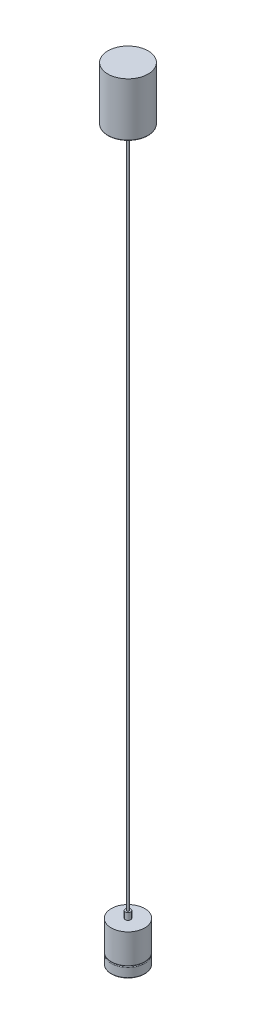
ISO-10303-21;
HEADER;
FILE_DESCRIPTION(('STEP AP214'),'2;1');
FILE_NAME('part.step','',(''),(''),'','','');
FILE_SCHEMA(('AUTOMOTIVE_DESIGN { 1 0 10303 214 1 1 1 1 }'));
ENDSEC;
DATA;
#1=APPLICATION_CONTEXT('core data for automotive mechanical design processes');
#2=APPLICATION_PROTOCOL_DEFINITION('international standard','automotive_design',2000,#1);
#3=PRODUCT_CONTEXT('',#1,'mechanical');
#4=PRODUCT('Part','Part','',(#3));
#5=PRODUCT_RELATED_PRODUCT_CATEGORY('part','',(#4));
#6=PRODUCT_DEFINITION_FORMATION('','',#4);
#7=PRODUCT_DEFINITION_CONTEXT('part definition',#1,'design');
#8=PRODUCT_DEFINITION('design','',#6,#7);
#9=PRODUCT_DEFINITION_SHAPE('','',#8);
#10=(LENGTH_UNIT() NAMED_UNIT(*) SI_UNIT(.MILLI.,.METRE.));
#11=(NAMED_UNIT(*) PLANE_ANGLE_UNIT() SI_UNIT($,.RADIAN.));
#12=(NAMED_UNIT(*) SI_UNIT($,.STERADIAN.) SOLID_ANGLE_UNIT());
#13=UNCERTAINTY_MEASURE_WITH_UNIT(LENGTH_MEASURE(1.E-05),#10,'distance_accuracy_value','');
#14=(GEOMETRIC_REPRESENTATION_CONTEXT(3) GLOBAL_UNCERTAINTY_ASSIGNED_CONTEXT((#13)) GLOBAL_UNIT_ASSIGNED_CONTEXT((#10,
#11,#12)) REPRESENTATION_CONTEXT('',''));
#15=CARTESIAN_POINT('',(0.,0.,0.));
#16=DIRECTION('',(0.,0.,1.));
#17=DIRECTION('',(1.,0.,0.));
#18=AXIS2_PLACEMENT_3D('',#15,#16,#17);
#19=CARTESIAN_POINT('',(-120.404013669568,-535.594040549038,1100.));
#20=DIRECTION('',(0.,1.,0.));
#21=DIRECTION('',(0.0841846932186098,0.,0.996450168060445));
#22=AXIS2_PLACEMENT_3D('',#19,#20,#21);
#23=CYLINDRICAL_SURFACE('',#22,15.);
#24=CARTESIAN_POINT('',(-120.404013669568,-535.594040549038,1100.));
#25=DIRECTION('',(0.,-1.,0.));
#26=DIRECTION('',(-0.0841846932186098,0.,-0.996450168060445));
#27=AXIS2_PLACEMENT_3D('',#24,#25,#26);
#28=CIRCLE('',#27,15.);
#29=CARTESIAN_POINT('',(-121.666784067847,-535.594040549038,1085.05324747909));
#30=VERTEX_POINT('',#29);
#31=EDGE_CURVE('P0_E10',#30,#30,#28,.T.);
#32=ORIENTED_EDGE('',*,*,#31,.F.);
#33=EDGE_LOOP('',(#32));
#34=FACE_BOUND('',#33,.T.);
#35=CARTESIAN_POINT('',(-120.404013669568,-535.394040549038,1100.));
#36=DIRECTION('',(0.,-1.,0.));
#37=DIRECTION('',(-0.0841846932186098,0.,-0.996450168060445));
#38=AXIS2_PLACEMENT_3D('',#35,#36,#37);
#39=CIRCLE('',#38,15.);
#40=CARTESIAN_POINT('',(-121.666784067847,-535.394040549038,1085.05324747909));
#41=VERTEX_POINT('',#40);
#42=EDGE_CURVE('P0_E18',#41,#41,#39,.T.);
#43=ORIENTED_EDGE('',*,*,#42,.T.);
#44=EDGE_LOOP('',(#43));
#45=FACE_BOUND('',#44,.T.);
#46=ADVANCED_FACE('P0_F15',(#34,#45),#23,.T.);
#47=CARTESIAN_POINT('',(-120.404013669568,-535.594040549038,1100.));
#48=DIRECTION('',(0.,-1.,0.));
#49=DIRECTION('',(-0.0841846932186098,0.,-0.996450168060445));
#50=AXIS2_PLACEMENT_3D('',#47,#48,#49);
#51=PLANE('',#50);
#52=ORIENTED_EDGE('',*,*,#31,.T.);
#53=EDGE_LOOP('',(#52));
#54=FACE_BOUND('',#53,.T.);
#55=ADVANCED_FACE('P0_F30',(#54),#51,.T.);
#56=CARTESIAN_POINT('',(-120.404013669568,-535.394040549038,1100.));
#57=DIRECTION('',(0.,-1.,0.));
#58=DIRECTION('',(-0.0841846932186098,0.,-0.996450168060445));
#59=AXIS2_PLACEMENT_3D('',#56,#57,#58);
#60=PLANE('',#59);
#61=ORIENTED_EDGE('',*,*,#42,.F.);
#62=EDGE_LOOP('',(#61));
#63=FACE_BOUND('',#62,.T.);
#64=ADVANCED_FACE('P0_F28',(#63),#60,.F.);
#65=CLOSED_SHELL('',(#46,#55,#64));
#66=MANIFOLD_SOLID_BREP('P0_B1',#65);
#67=CARTESIAN_POINT('',(-120.404013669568,-465.394040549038,1100.));
#68=DIRECTION('',(0.,1.,0.));
#69=DIRECTION('',(0.,0.,1.));
#70=AXIS2_PLACEMENT_3D('',#67,#68,#69);
#71=CYLINDRICAL_SURFACE('',#70,1.5);
#72=CARTESIAN_POINT('',(-120.404013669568,-465.394040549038,1100.));
#73=DIRECTION('',(0.,-1.,0.));
#74=DIRECTION('',(0.,0.,-1.));
#75=AXIS2_PLACEMENT_3D('',#72,#73,#74);
#76=CIRCLE('',#75,1.5);
#77=CARTESIAN_POINT('',(-120.404013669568,-465.394040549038,1098.5));
#78=VERTEX_POINT('',#77);
#79=EDGE_CURVE('P1_E10',#78,#78,#76,.T.);
#80=ORIENTED_EDGE('',*,*,#79,.F.);
#81=EDGE_LOOP('',(#80));
#82=FACE_BOUND('',#81,.T.);
#83=CARTESIAN_POINT('',(-120.404013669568,534.605959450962,1100.));
#84=DIRECTION('',(0.,-1.,0.));
#85=DIRECTION('',(0.,0.,-1.));
#86=AXIS2_PLACEMENT_3D('',#83,#84,#85);
#87=CIRCLE('',#86,1.5);
#88=CARTESIAN_POINT('',(-120.404013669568,534.605959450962,1098.5));
#89=VERTEX_POINT('',#88);
#90=EDGE_CURVE('P1_E18',#89,#89,#87,.T.);
#91=ORIENTED_EDGE('',*,*,#90,.T.);
#92=EDGE_LOOP('',(#91));
#93=FACE_BOUND('',#92,.T.);
#94=ADVANCED_FACE('P1_F15',(#82,#93),#71,.T.);
#95=CARTESIAN_POINT('',(-120.404013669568,534.605959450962,1100.));
#96=DIRECTION('',(0.,-1.,0.));
#97=DIRECTION('',(0.,0.,-1.));
#98=AXIS2_PLACEMENT_3D('',#95,#96,#97);
#99=PLANE('',#98);
#100=ORIENTED_EDGE('',*,*,#90,.F.);
#101=EDGE_LOOP('',(#100));
#102=FACE_BOUND('',#101,.T.);
#103=ADVANCED_FACE('P1_F38',(#102),#99,.F.);
#104=CARTESIAN_POINT('',(-120.404013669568,-475.394040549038,1100.));
#105=DIRECTION('',(0.,1.,0.));
#106=DIRECTION('',(0.,0.,1.));
#107=AXIS2_PLACEMENT_3D('',#104,#105,#106);
#108=CYLINDRICAL_SURFACE('',#107,4.);
#109=CARTESIAN_POINT('',(-120.404013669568,-475.394040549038,1100.));
#110=DIRECTION('',(0.,-1.,0.));
#111=DIRECTION('',(0.,0.,-1.));
#112=AXIS2_PLACEMENT_3D('',#109,#110,#111);
#113=CIRCLE('',#112,4.);
#114=CARTESIAN_POINT('',(-120.404013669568,-475.394040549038,1096.));
#115=VERTEX_POINT('',#114);
#116=EDGE_CURVE('P1_E25',#115,#115,#113,.T.);
#117=ORIENTED_EDGE('',*,*,#116,.F.);
#118=EDGE_LOOP('',(#117));
#119=FACE_BOUND('',#118,.T.);
#120=CARTESIAN_POINT('',(-120.404013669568,-465.394040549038,1100.));
#121=DIRECTION('',(0.,-1.,0.));
#122=DIRECTION('',(0.,0.,-1.));
#123=AXIS2_PLACEMENT_3D('',#120,#121,#122);
#124=CIRCLE('',#123,4.);
#125=CARTESIAN_POINT('',(-120.404013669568,-465.394040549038,1096.));
#126=VERTEX_POINT('',#125);
#127=EDGE_CURVE('P1_E27',#126,#126,#124,.T.);
#128=ORIENTED_EDGE('',*,*,#127,.T.);
#129=EDGE_LOOP('',(#128));
#130=FACE_BOUND('',#129,.T.);
#131=ADVANCED_FACE('P1_F35',(#119,#130),#108,.T.);
#132=CARTESIAN_POINT('',(-120.404013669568,-475.394040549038,1100.));
#133=DIRECTION('',(0.,-1.,0.));
#134=DIRECTION('',(0.,0.,-1.));
#135=AXIS2_PLACEMENT_3D('',#132,#133,#134);
#136=PLANE('',#135);
#137=ORIENTED_EDGE('',*,*,#116,.T.);
#138=EDGE_LOOP('',(#137));
#139=FACE_BOUND('',#138,.T.);
#140=ADVANCED_FACE('P1_F33',(#139),#136,.T.);
#141=CARTESIAN_POINT('',(-120.404013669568,-465.394040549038,1100.));
#142=DIRECTION('',(0.,-1.,0.));
#143=DIRECTION('',(0.,0.,-1.));
#144=AXIS2_PLACEMENT_3D('',#141,#142,#143);
#145=PLANE('',#144);
#146=ORIENTED_EDGE('',*,*,#79,.T.);
#147=EDGE_LOOP('',(#146));
#148=FACE_BOUND('',#147,.T.);
#149=ORIENTED_EDGE('',*,*,#127,.F.);
#150=EDGE_LOOP('',(#149));
#151=FACE_BOUND('',#150,.T.);
#152=ADVANCED_FACE('P1_F42',(#148,#151),#145,.F.);
#153=CLOSED_SHELL('',(#94,#103,#131,#140,#152));
#154=MANIFOLD_SOLID_BREP('P1_B1',#153);
#155=CARTESIAN_POINT('',(-120.404013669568,534.605959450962,1100.));
#156=DIRECTION('',(0.,1.,0.));
#157=DIRECTION('',(0.,0.,1.));
#158=AXIS2_PLACEMENT_3D('',#155,#156,#157);
#159=CYLINDRICAL_SURFACE('',#158,7.5);
#160=CARTESIAN_POINT('',(-120.404013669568,534.605959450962,1100.));
#161=DIRECTION('',(0.,-1.,0.));
#162=DIRECTION('',(0.,0.,-1.));
#163=AXIS2_PLACEMENT_3D('',#160,#161,#162);
#164=CIRCLE('',#163,7.5);
#165=CARTESIAN_POINT('',(-120.404013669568,534.605959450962,1092.5));
#166=VERTEX_POINT('',#165);
#167=EDGE_CURVE('P2_E10',#166,#166,#164,.T.);
#168=ORIENTED_EDGE('',*,*,#167,.F.);
#169=EDGE_LOOP('',(#168));
#170=FACE_BOUND('',#169,.T.);
#171=CARTESIAN_POINT('',(-120.404013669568,549.605959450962,1100.));
#172=DIRECTION('',(0.,-1.,0.));
#173=DIRECTION('',(0.,0.,-1.));
#174=AXIS2_PLACEMENT_3D('',#171,#172,#173);
#175=CIRCLE('',#174,7.5);
#176=CARTESIAN_POINT('',(-120.404013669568,549.605959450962,1092.5));
#177=VERTEX_POINT('',#176);
#178=EDGE_CURVE('P2_E18',#177,#177,#175,.T.);
#179=ORIENTED_EDGE('',*,*,#178,.T.);
#180=EDGE_LOOP('',(#179));
#181=FACE_BOUND('',#180,.T.);
#182=ADVANCED_FACE('P2_F15',(#170,#181),#159,.T.);
#183=CARTESIAN_POINT('',(-120.404013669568,534.605959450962,1100.));
#184=DIRECTION('',(0.,-1.,0.));
#185=DIRECTION('',(0.,0.,-1.));
#186=AXIS2_PLACEMENT_3D('',#183,#184,#185);
#187=PLANE('',#186);
#188=ORIENTED_EDGE('',*,*,#167,.T.);
#189=EDGE_LOOP('',(#188));
#190=FACE_BOUND('',#189,.T.);
#191=ADVANCED_FACE('P2_F30',(#190),#187,.T.);
#192=CARTESIAN_POINT('',(-120.404013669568,549.605959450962,1100.));
#193=DIRECTION('',(0.,-1.,0.));
#194=DIRECTION('',(0.,0.,-1.));
#195=AXIS2_PLACEMENT_3D('',#192,#193,#194);
#196=PLANE('',#195);
#197=ORIENTED_EDGE('',*,*,#178,.F.);
#198=EDGE_LOOP('',(#197));
#199=FACE_BOUND('',#198,.T.);
#200=ADVANCED_FACE('P2_F28',(#199),#196,.F.);
#201=CLOSED_SHELL('',(#182,#191,#200));
#202=MANIFOLD_SOLID_BREP('P2_B1',#201);
#203=CARTESIAN_POINT('',(-120.404013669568,629.605959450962,1100.));
#204=DIRECTION('',(0.,-1.,0.));
#205=DIRECTION('',(0.,0.,-1.));
#206=AXIS2_PLACEMENT_3D('',#203,#204,#205);
#207=CYLINDRICAL_SURFACE('',#206,30.);
#208=CARTESIAN_POINT('',(-120.404013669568,550.605959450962,1100.));
#209=DIRECTION('',(0.,1.,0.));
#210=DIRECTION('',(0.,0.,1.));
#211=AXIS2_PLACEMENT_3D('',#208,#209,#210);
#212=CIRCLE('',#211,30.);
#213=CARTESIAN_POINT('',(-120.404013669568,550.605959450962,1130.));
#214=VERTEX_POINT('',#213);
#215=EDGE_CURVE('P3_E22',#214,#214,#212,.T.);
#216=ORIENTED_EDGE('',*,*,#215,.T.);
#217=EDGE_LOOP('',(#216));
#218=FACE_BOUND('',#217,.T.);
#219=CARTESIAN_POINT('',(-120.404013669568,629.605959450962,1100.));
#220=DIRECTION('',(0.,1.,0.));
#221=DIRECTION('',(0.,0.,1.));
#222=AXIS2_PLACEMENT_3D('',#219,#220,#221);
#223=CIRCLE('',#222,30.);
#224=CARTESIAN_POINT('',(-120.404013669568,629.605959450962,1130.));
#225=VERTEX_POINT('',#224);
#226=EDGE_CURVE('P3_E26',#225,#225,#223,.T.);
#227=ORIENTED_EDGE('',*,*,#226,.F.);
#228=EDGE_LOOP('',(#227));
#229=FACE_BOUND('',#228,.T.);
#230=ADVANCED_FACE('P3_F15',(#218,#229),#207,.T.);
#231=CARTESIAN_POINT('',(-120.404013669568,629.605959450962,1100.));
#232=DIRECTION('',(0.,1.,0.));
#233=DIRECTION('',(0.,0.,1.));
#234=AXIS2_PLACEMENT_3D('',#231,#232,#233);
#235=PLANE('',#234);
#236=ORIENTED_EDGE('',*,*,#226,.T.);
#237=EDGE_LOOP('',(#236));
#238=FACE_BOUND('',#237,.T.);
#239=ADVANCED_FACE('P3_F33',(#238),#235,.T.);
#240=CARTESIAN_POINT('',(-120.404013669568,549.605959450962,1100.));
#241=DIRECTION('',(0.,1.,0.));
#242=DIRECTION('',(0.,0.,1.));
#243=AXIS2_PLACEMENT_3D('',#240,#241,#242);
#244=PLANE('',#243);
#245=CARTESIAN_POINT('',(-120.404013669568,549.605959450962,1100.));
#246=DIRECTION('',(0.,1.,0.));
#247=DIRECTION('',(0.,0.,1.));
#248=AXIS2_PLACEMENT_3D('',#245,#246,#247);
#249=CIRCLE('',#248,29.);
#250=CARTESIAN_POINT('',(-120.404013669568,549.605959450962,1129.));
#251=VERTEX_POINT('',#250);
#252=EDGE_CURVE('P3_E10',#251,#251,#249,.F.);
#253=ORIENTED_EDGE('',*,*,#252,.T.);
#254=EDGE_LOOP('',(#253));
#255=FACE_BOUND('',#254,.T.);
#256=ADVANCED_FACE('P3_F40',(#255),#244,.F.);
#257=CARTESIAN_POINT('',(-120.404013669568,550.605959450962,1100.));
#258=DIRECTION('',(0.,1.,0.));
#259=DIRECTION('',(0.,0.,1.));
#260=AXIS2_PLACEMENT_3D('',#257,#258,#259);
#261=TOROIDAL_SURFACE('',#260,29.,1.);
#262=ORIENTED_EDGE('',*,*,#252,.F.);
#263=EDGE_LOOP('',(#262));
#264=FACE_BOUND('',#263,.T.);
#265=ORIENTED_EDGE('',*,*,#215,.F.);
#266=EDGE_LOOP('',(#265));
#267=FACE_BOUND('',#266,.T.);
#268=ADVANCED_FACE('P3_F17',(#264,#267),#261,.T.);
#269=CLOSED_SHELL('',(#230,#239,#256,#268));
#270=MANIFOLD_SOLID_BREP('P3_B1',#269);
#271=CARTESIAN_POINT('',(-120.404013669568,-475.394040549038,1100.));
#272=DIRECTION('',(0.,-1.,0.));
#273=DIRECTION('',(-0.0841846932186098,0.,-0.996450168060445));
#274=AXIS2_PLACEMENT_3D('',#271,#272,#273);
#275=CYLINDRICAL_SURFACE('',#274,25.);
#276=CARTESIAN_POINT('',(-120.404013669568,-518.894040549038,1100.));
#277=DIRECTION('',(0.,1.,0.));
#278=DIRECTION('',(0.0841846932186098,0.,0.996450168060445));
#279=AXIS2_PLACEMENT_3D('',#276,#277,#278);
#280=CIRCLE('',#279,25.);
#281=CARTESIAN_POINT('',(-122.508631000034,-518.894040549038,1075.08874579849));
#282=VERTEX_POINT('',#281);
#283=EDGE_CURVE('P4_E27',#282,#282,#280,.T.);
#284=CARTESIAN_POINT('',(-120.404013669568,-475.394040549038,1100.));
#285=DIRECTION('',(0.,1.,0.));
#286=DIRECTION('',(0.0841846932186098,0.,0.996450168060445));
#287=AXIS2_PLACEMENT_3D('',#284,#285,#286);
#288=CIRCLE('',#287,25.);
#289=CARTESIAN_POINT('',(-122.508631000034,-475.394040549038,1075.08874579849));
#290=VERTEX_POINT('',#289);
#291=EDGE_CURVE('P4_E31',#290,#290,#288,.T.);
#292=CARTESIAN_POINT('',(-122.508631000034,-518.894040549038,1075.08874579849));
#293=CARTESIAN_POINT('',(-122.508631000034,-518.440915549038,1075.08874579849));
#294=CARTESIAN_POINT('',(-122.508631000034,-517.987790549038,1075.08874579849));
#295=CARTESIAN_POINT('',(-122.508631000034,-517.081540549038,1075.08874579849));
#296=CARTESIAN_POINT('',(-122.508631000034,-516.628415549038,1075.08874579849));
#297=CARTESIAN_POINT('',(-122.508631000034,-515.722165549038,1075.08874579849));
#298=CARTESIAN_POINT('',(-122.508631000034,-515.269040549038,1075.08874579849));
#299=CARTESIAN_POINT('',(-122.508631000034,-514.362790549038,1075.08874579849));
#300=CARTESIAN_POINT('',(-122.508631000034,-513.909665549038,1075.08874579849));
#301=CARTESIAN_POINT('',(-122.508631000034,-513.003415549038,1075.08874579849));
#302=CARTESIAN_POINT('',(-122.508631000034,-512.550290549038,1075.08874579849));
#303=CARTESIAN_POINT('',(-122.508631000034,-511.644040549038,1075.08874579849));
#304=CARTESIAN_POINT('',(-122.508631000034,-511.190915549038,1075.08874579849));
#305=CARTESIAN_POINT('',(-122.508631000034,-510.284665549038,1075.08874579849));
#306=CARTESIAN_POINT('',(-122.508631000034,-509.831540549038,1075.08874579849));
#307=CARTESIAN_POINT('',(-122.508631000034,-508.925290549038,1075.08874579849));
#308=CARTESIAN_POINT('',(-122.508631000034,-508.472165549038,1075.08874579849));
#309=CARTESIAN_POINT('',(-122.508631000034,-507.565915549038,1075.08874579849));
#310=CARTESIAN_POINT('',(-122.508631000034,-507.112790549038,1075.08874579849));
#311=CARTESIAN_POINT('',(-122.508631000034,-506.206540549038,1075.08874579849));
#312=CARTESIAN_POINT('',(-122.508631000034,-505.753415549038,1075.08874579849));
#313=CARTESIAN_POINT('',(-122.508631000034,-504.847165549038,1075.08874579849));
#314=CARTESIAN_POINT('',(-122.508631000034,-504.394040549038,1075.08874579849));
#315=CARTESIAN_POINT('',(-122.508631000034,-503.487790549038,1075.08874579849));
#316=CARTESIAN_POINT('',(-122.508631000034,-503.034665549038,1075.08874579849));
#317=CARTESIAN_POINT('',(-122.508631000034,-502.128415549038,1075.08874579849));
#318=CARTESIAN_POINT('',(-122.508631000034,-501.675290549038,1075.08874579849));
#319=CARTESIAN_POINT('',(-122.508631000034,-500.769040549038,1075.08874579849));
#320=CARTESIAN_POINT('',(-122.508631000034,-500.315915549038,1075.08874579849));
#321=CARTESIAN_POINT('',(-122.508631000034,-499.409665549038,1075.08874579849));
#322=CARTESIAN_POINT('',(-122.508631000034,-498.956540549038,1075.08874579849));
#323=CARTESIAN_POINT('',(-122.508631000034,-498.050290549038,1075.08874579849));
#324=CARTESIAN_POINT('',(-122.508631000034,-497.597165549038,1075.08874579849));
#325=CARTESIAN_POINT('',(-122.508631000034,-496.690915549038,1075.08874579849));
#326=CARTESIAN_POINT('',(-122.508631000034,-496.237790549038,1075.08874579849));
#327=CARTESIAN_POINT('',(-122.508631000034,-495.331540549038,1075.08874579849));
#328=CARTESIAN_POINT('',(-122.508631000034,-494.878415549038,1075.08874579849));
#329=CARTESIAN_POINT('',(-122.508631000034,-493.972165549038,1075.08874579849));
#330=CARTESIAN_POINT('',(-122.508631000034,-493.519040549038,1075.08874579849));
#331=CARTESIAN_POINT('',(-122.508631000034,-492.612790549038,1075.08874579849));
#332=CARTESIAN_POINT('',(-122.508631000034,-492.159665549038,1075.08874579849));
#333=CARTESIAN_POINT('',(-122.508631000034,-491.253415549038,1075.08874579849));
#334=CARTESIAN_POINT('',(-122.508631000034,-490.800290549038,1075.08874579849));
#335=CARTESIAN_POINT('',(-122.508631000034,-489.894040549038,1075.08874579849));
#336=CARTESIAN_POINT('',(-122.508631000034,-489.440915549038,1075.08874579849));
#337=CARTESIAN_POINT('',(-122.508631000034,-488.534665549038,1075.08874579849));
#338=CARTESIAN_POINT('',(-122.508631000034,-488.081540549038,1075.08874579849));
#339=CARTESIAN_POINT('',(-122.508631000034,-487.175290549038,1075.08874579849));
#340=CARTESIAN_POINT('',(-122.508631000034,-486.722165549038,1075.08874579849));
#341=CARTESIAN_POINT('',(-122.508631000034,-485.815915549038,1075.08874579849));
#342=CARTESIAN_POINT('',(-122.508631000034,-485.362790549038,1075.08874579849));
#343=CARTESIAN_POINT('',(-122.508631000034,-484.456540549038,1075.08874579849));
#344=CARTESIAN_POINT('',(-122.508631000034,-484.003415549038,1075.08874579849));
#345=CARTESIAN_POINT('',(-122.508631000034,-483.097165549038,1075.08874579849));
#346=CARTESIAN_POINT('',(-122.508631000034,-482.644040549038,1075.08874579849));
#347=CARTESIAN_POINT('',(-122.508631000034,-481.737790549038,1075.08874579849));
#348=CARTESIAN_POINT('',(-122.508631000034,-481.284665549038,1075.08874579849));
#349=CARTESIAN_POINT('',(-122.508631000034,-480.378415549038,1075.08874579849));
#350=CARTESIAN_POINT('',(-122.508631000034,-479.925290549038,1075.08874579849));
#351=CARTESIAN_POINT('',(-122.508631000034,-479.019040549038,1075.08874579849));
#352=CARTESIAN_POINT('',(-122.508631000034,-478.565915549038,1075.08874579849));
#353=CARTESIAN_POINT('',(-122.508631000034,-477.659665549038,1075.08874579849));
#354=CARTESIAN_POINT('',(-122.508631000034,-477.206540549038,1075.08874579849));
#355=CARTESIAN_POINT('',(-122.508631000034,-476.300290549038,1075.08874579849));
#356=CARTESIAN_POINT('',(-122.508631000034,-475.847165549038,1075.08874579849));
#357=CARTESIAN_POINT('',(-122.508631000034,-475.394040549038,1075.08874579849));
#358=B_SPLINE_CURVE_WITH_KNOTS('',3,(#292,#293,#294,#295,#296,#297,#298,#299,#300,#301,#302,
#303,#304,#305,#306,#307,#308,#309,#310,#311,#312,#313,#314,#315,#316,#317,#318,#319,#320,#321,
#322,#323,#324,#325,#326,#327,#328,#329,#330,#331,#332,#333,#334,#335,#336,#337,#338,#339,#340,
#341,#342,#343,#344,#345,#346,#347,#348,#349,#350,#351,#352,#353,#354,#355,#356,#357),
.UNSPECIFIED.,.F.,.F.,(4,2,2,2,2,2,2,2,2,2,2,2,2,2,2,2,2,2,2,2,2,2,2,2,2,2,2,2,2,2,2,2,4),(0.,
1.35937500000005,2.71874999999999,4.07812500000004,5.4375000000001,6.79687500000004,
8.15625000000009,9.51562500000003,10.8750000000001,12.234375,13.5937500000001,14.953125,
16.3125000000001,17.671875,19.0312500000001,20.390625,21.75,23.109375,24.46875,25.828125,
27.1875,28.546875,29.90625,31.265625,32.625,33.984375,35.34375,36.703125,38.0625,39.421875,
40.78125,42.140625,43.5),.UNSPECIFIED.);
#359=EDGE_CURVE('P4_BSEAM15',#282,#290,#358,.T.);
#360=ORIENTED_EDGE('',*,*,#283,.T.);
#361=ORIENTED_EDGE('',*,*,#291,.F.);
#362=ORIENTED_EDGE('',*,*,#359,.T.);
#363=ORIENTED_EDGE('',*,*,#359,.F.);
#364=EDGE_LOOP('',(#360,#362,#361,#363));
#365=FACE_BOUND('',#364,.T.);
#366=ADVANCED_FACE('P4_F15',(#365),#275,.T.);
#367=CARTESIAN_POINT('',(-120.404013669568,-475.394040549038,1100.));
#368=DIRECTION('',(0.,1.,0.));
#369=DIRECTION('',(0.0841846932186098,0.,0.996450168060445));
#370=AXIS2_PLACEMENT_3D('',#367,#368,#369);
#371=PLANE('',#370);
#372=ORIENTED_EDGE('',*,*,#291,.T.);
#373=EDGE_LOOP('',(#372));
#374=FACE_BOUND('',#373,.T.);
#375=ADVANCED_FACE('P4_F94',(#374),#371,.T.);
#376=CARTESIAN_POINT('',(-120.404013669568,-520.394040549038,1100.));
#377=DIRECTION('',(0.,1.,0.));
#378=DIRECTION('',(0.0841846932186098,0.,0.996450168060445));
#379=AXIS2_PLACEMENT_3D('',#376,#377,#378);
#380=PLANE('',#379);
#381=CARTESIAN_POINT('',(-120.404013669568,-520.394040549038,1100.));
#382=DIRECTION('',(0.,1.,0.));
#383=DIRECTION('',(0.0841846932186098,0.,0.996450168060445));
#384=AXIS2_PLACEMENT_3D('',#381,#382,#383);
#385=CIRCLE('',#384,23.5);
#386=CARTESIAN_POINT('',(-118.425673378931,-520.394040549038,1123.41657894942));
#387=VERTEX_POINT('',#386);
#388=EDGE_CURVE('P4_E23',#387,#387,#385,.F.);
#389=ORIENTED_EDGE('',*,*,#388,.T.);
#390=EDGE_LOOP('',(#389));
#391=FACE_BOUND('',#390,.T.);
#392=ADVANCED_FACE('P4_F87',(#391),#380,.F.);
#393=CARTESIAN_POINT('',(-120.404013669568,-518.894040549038,1100.));
#394=DIRECTION('',(0.,1.,0.));
#395=DIRECTION('',(0.0841846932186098,0.,0.996450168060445));
#396=AXIS2_PLACEMENT_3D('',#393,#394,#395);
#397=TOROIDAL_SURFACE('',#396,23.5,1.5);
#398=ORIENTED_EDGE('',*,*,#388,.F.);
#399=EDGE_LOOP('',(#398));
#400=FACE_BOUND('',#399,.T.);
#401=ORIENTED_EDGE('',*,*,#283,.F.);
#402=EDGE_LOOP('',(#401));
#403=FACE_BOUND('',#402,.T.);
#404=ADVANCED_FACE('P4_F17',(#400,#403),#397,.T.);
#405=CLOSED_SHELL('',(#366,#375,#392,#404));
#406=CARTESIAN_POINT('',(-120.404013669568,-476.394040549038,1100.));
#407=DIRECTION('',(0.,1.,0.));
#408=DIRECTION('',(0.0841846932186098,0.,0.996450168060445));
#409=AXIS2_PLACEMENT_3D('',#406,#407,#408);
#410=PLANE('',#409);
#411=CARTESIAN_POINT('',(-120.404013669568,-476.394040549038,1100.));
#412=DIRECTION('',(0.,1.,0.));
#413=DIRECTION('',(0.0841846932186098,0.,0.996450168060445));
#414=AXIS2_PLACEMENT_3D('',#411,#412,#413);
#415=CIRCLE('',#414,21.);
#416=CARTESIAN_POINT('',(-118.636135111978,-476.394040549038,1120.92545352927));
#417=VERTEX_POINT('',#416);
#418=EDGE_CURVE('P4_E9',#417,#417,#415,.F.);
#419=ORIENTED_EDGE('',*,*,#418,.T.);
#420=EDGE_LOOP('',(#419));
#421=FACE_BOUND('',#420,.T.);
#422=ADVANCED_FACE('P4_F51',(#421),#410,.F.);
#423=CARTESIAN_POINT('',(-120.404013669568,-497.394040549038,1100.));
#424=DIRECTION('',(0.,1.,0.));
#425=DIRECTION('',(0.0841846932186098,0.,0.996450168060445));
#426=AXIS2_PLACEMENT_3D('',#423,#424,#425);
#427=PLANE('',#426);
#428=CARTESIAN_POINT('',(-120.404013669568,-497.394040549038,1100.));
#429=DIRECTION('',(0.,1.,0.));
#430=DIRECTION('',(0.0841846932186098,0.,0.996450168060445));
#431=AXIS2_PLACEMENT_3D('',#428,#429,#430);
#432=CIRCLE('',#431,21.);
#433=CARTESIAN_POINT('',(-118.636135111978,-497.394040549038,1120.92545352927));
#434=VERTEX_POINT('',#433);
#435=EDGE_CURVE('P4_E36',#434,#434,#432,.T.);
#436=ORIENTED_EDGE('',*,*,#435,.T.);
#437=EDGE_LOOP('',(#436));
#438=FACE_BOUND('',#437,.T.);
#439=ADVANCED_FACE('P4_F40',(#438),#427,.T.);
#440=CARTESIAN_POINT('',(-120.404013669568,-497.394040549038,1100.));
#441=DIRECTION('',(0.,1.,0.));
#442=DIRECTION('',(0.0841846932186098,0.,0.996450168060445));
#443=AXIS2_PLACEMENT_3D('',#440,#441,#442);
#444=CYLINDRICAL_SURFACE('',#443,21.);
#445=ORIENTED_EDGE('',*,*,#435,.F.);
#446=EDGE_LOOP('',(#445));
#447=FACE_BOUND('',#446,.T.);
#448=ORIENTED_EDGE('',*,*,#418,.F.);
#449=EDGE_LOOP('',(#448));
#450=FACE_BOUND('',#449,.T.);
#451=ADVANCED_FACE('P4_F42',(#447,#450),#444,.F.);
#452=CLOSED_SHELL('',(#422,#439,#451));
#453=ORIENTED_CLOSED_SHELL('',*,#452,.T.);
#454=BREP_WITH_VOIDS('P4_B1',#405,(#453));
#455=CARTESIAN_POINT('',(-120.404013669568,-535.394040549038,1100.));
#456=DIRECTION('',(0.,1.,0.));
#457=DIRECTION('',(0.0841846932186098,0.,0.996450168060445));
#458=AXIS2_PLACEMENT_3D('',#455,#456,#457);
#459=CYLINDRICAL_SURFACE('',#458,25.);
#460=CARTESIAN_POINT('',(-120.404013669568,-534.394040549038,1100.));
#461=DIRECTION('',(0.,-1.,0.));
#462=DIRECTION('',(-0.0841846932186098,0.,-0.996450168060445));
#463=AXIS2_PLACEMENT_3D('',#460,#461,#462);
#464=CIRCLE('',#463,25.);
#465=CARTESIAN_POINT('',(-122.508631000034,-534.394040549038,1075.08874579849));
#466=VERTEX_POINT('',#465);
#467=EDGE_CURVE('P5_E22',#466,#466,#464,.F.);
#468=ORIENTED_EDGE('',*,*,#467,.T.);
#469=EDGE_LOOP('',(#468));
#470=FACE_BOUND('',#469,.T.);
#471=CARTESIAN_POINT('',(-120.404013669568,-521.394040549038,1100.));
#472=DIRECTION('',(0.,-1.,0.));
#473=DIRECTION('',(-0.0841846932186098,0.,-0.996450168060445));
#474=AXIS2_PLACEMENT_3D('',#471,#472,#473);
#475=CIRCLE('',#474,25.);
#476=CARTESIAN_POINT('',(-122.508631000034,-521.394040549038,1075.08874579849));
#477=VERTEX_POINT('',#476);
#478=EDGE_CURVE('P5_E26',#477,#477,#475,.T.);
#479=ORIENTED_EDGE('',*,*,#478,.T.);
#480=EDGE_LOOP('',(#479));
#481=FACE_BOUND('',#480,.T.);
#482=ADVANCED_FACE('P5_F15',(#470,#481),#459,.T.);
#483=CARTESIAN_POINT('',(-120.404013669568,-535.394040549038,1100.));
#484=DIRECTION('',(0.,-1.,0.));
#485=DIRECTION('',(-0.0841846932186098,0.,-0.996450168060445));
#486=AXIS2_PLACEMENT_3D('',#483,#484,#485);
#487=PLANE('',#486);
#488=CARTESIAN_POINT('',(-120.404013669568,-535.394040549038,1100.));
#489=DIRECTION('',(0.,-1.,0.));
#490=DIRECTION('',(-0.0841846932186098,0.,-0.996450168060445));
#491=AXIS2_PLACEMENT_3D('',#488,#489,#490);
#492=CIRCLE('',#491,24.);
#493=CARTESIAN_POINT('',(-122.424446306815,-535.394040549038,1076.08519596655));
#494=VERTEX_POINT('',#493);
#495=EDGE_CURVE('P5_E30',#494,#494,#492,.T.);
#496=ORIENTED_EDGE('',*,*,#495,.T.);
#497=EDGE_LOOP('',(#496));
#498=FACE_BOUND('',#497,.T.);
#499=ADVANCED_FACE('P5_F36',(#498),#487,.T.);
#500=CARTESIAN_POINT('',(-120.404013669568,-520.394040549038,1100.));
#501=DIRECTION('',(0.,-1.,0.));
#502=DIRECTION('',(-0.0841846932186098,0.,-0.996450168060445));
#503=AXIS2_PLACEMENT_3D('',#500,#501,#502);
#504=PLANE('',#503);
#505=CARTESIAN_POINT('',(-120.404013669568,-520.394040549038,1100.));
#506=DIRECTION('',(0.,-1.,0.));
#507=DIRECTION('',(-0.0841846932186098,0.,-0.996450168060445));
#508=AXIS2_PLACEMENT_3D('',#505,#506,#507);
#509=CIRCLE('',#508,24.);
#510=CARTESIAN_POINT('',(-122.424446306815,-520.394040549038,1076.08519596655));
#511=VERTEX_POINT('',#510);
#512=EDGE_CURVE('P5_E10',#511,#511,#509,.F.);
#513=ORIENTED_EDGE('',*,*,#512,.T.);
#514=EDGE_LOOP('',(#513));
#515=FACE_BOUND('',#514,.T.);
#516=ADVANCED_FACE('P5_F40',(#515),#504,.F.);
#517=CARTESIAN_POINT('',(-120.404013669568,-534.394040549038,1100.));
#518=DIRECTION('',(0.,-1.,0.));
#519=DIRECTION('',(-0.0841846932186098,0.,-0.996450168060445));
#520=AXIS2_PLACEMENT_3D('',#517,#518,#519);
#521=TOROIDAL_SURFACE('',#520,24.,1.);
#522=ORIENTED_EDGE('',*,*,#467,.F.);
#523=EDGE_LOOP('',(#522));
#524=FACE_BOUND('',#523,.T.);
#525=ORIENTED_EDGE('',*,*,#495,.F.);
#526=EDGE_LOOP('',(#525));
#527=FACE_BOUND('',#526,.T.);
#528=ADVANCED_FACE('P5_F38',(#524,#527),#521,.T.);
#529=CARTESIAN_POINT('',(-120.404013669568,-521.394040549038,1100.));
#530=DIRECTION('',(0.,-1.,0.));
#531=DIRECTION('',(-0.0841846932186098,0.,-0.996450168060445));
#532=AXIS2_PLACEMENT_3D('',#529,#530,#531);
#533=TOROIDAL_SURFACE('',#532,24.,1.);
#534=ORIENTED_EDGE('',*,*,#512,.F.);
#535=EDGE_LOOP('',(#534));
#536=FACE_BOUND('',#535,.T.);
#537=ORIENTED_EDGE('',*,*,#478,.F.);
#538=EDGE_LOOP('',(#537));
#539=FACE_BOUND('',#538,.T.);
#540=ADVANCED_FACE('P5_F17',(#536,#539),#533,.T.);
#541=CLOSED_SHELL('',(#482,#499,#516,#528,#540));
#542=MANIFOLD_SOLID_BREP('P5_B1',#541);
#543=ADVANCED_BREP_SHAPE_REPRESENTATION('',(#18,#66,#154,#202,#270,#454,#542),#14);
#544=SHAPE_DEFINITION_REPRESENTATION(#9,#543);
ENDSEC;
END-ISO-10303-21;
